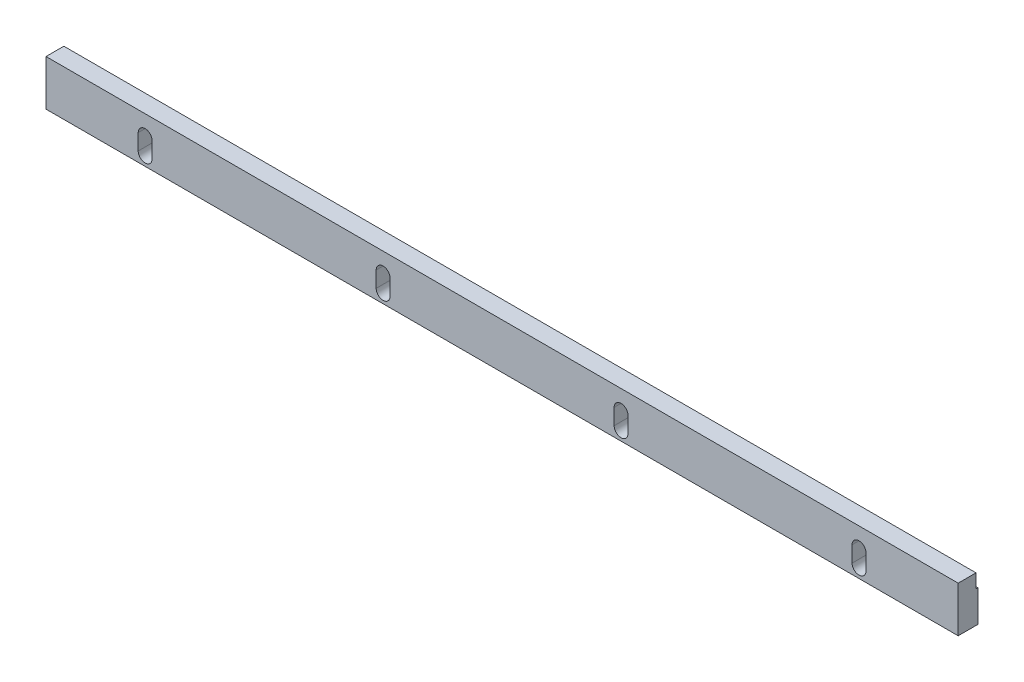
ISO-10303-21;
HEADER;
FILE_DESCRIPTION(('STEP AP214'),'2;1');
FILE_NAME('part.step','',(''),(''),'','','');
FILE_SCHEMA(('AUTOMOTIVE_DESIGN { 1 0 10303 214 1 1 1 1 }'));
ENDSEC;
DATA;
#1=APPLICATION_CONTEXT('core data for automotive mechanical design processes');
#2=APPLICATION_PROTOCOL_DEFINITION('international standard','automotive_design',2000,#1);
#3=PRODUCT_CONTEXT('',#1,'mechanical');
#4=PRODUCT('Part','Part','',(#3));
#5=PRODUCT_RELATED_PRODUCT_CATEGORY('part','',(#4));
#6=PRODUCT_DEFINITION_FORMATION('','',#4);
#7=PRODUCT_DEFINITION_CONTEXT('part definition',#1,'design');
#8=PRODUCT_DEFINITION('design','',#6,#7);
#9=PRODUCT_DEFINITION_SHAPE('','',#8);
#10=(LENGTH_UNIT() NAMED_UNIT(*) SI_UNIT(.MILLI.,.METRE.));
#11=(NAMED_UNIT(*) PLANE_ANGLE_UNIT() SI_UNIT($,.RADIAN.));
#12=(NAMED_UNIT(*) SI_UNIT($,.STERADIAN.) SOLID_ANGLE_UNIT());
#13=UNCERTAINTY_MEASURE_WITH_UNIT(LENGTH_MEASURE(1.E-05),#10,'distance_accuracy_value','');
#14=(GEOMETRIC_REPRESENTATION_CONTEXT(3) GLOBAL_UNCERTAINTY_ASSIGNED_CONTEXT((#13)) GLOBAL_UNIT_ASSIGNED_CONTEXT((#10,
#11,#12)) REPRESENTATION_CONTEXT('',''));
#15=CARTESIAN_POINT('',(0.,0.,0.));
#16=DIRECTION('',(0.,0.,1.));
#17=DIRECTION('',(1.,0.,0.));
#18=AXIS2_PLACEMENT_3D('',#15,#16,#17);
#19=CARTESIAN_POINT('',(0.,-13.3541654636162,5.));
#20=DIRECTION('',(-1.,0.,0.));
#21=DIRECTION('',(0.,-1.,0.));
#22=AXIS2_PLACEMENT_3D('',#19,#20,#21);
#23=PLANE('',#22);
#24=DIRECTION('',(0.,0.,1.));
#25=VECTOR('',#24,1.);
#26=CARTESIAN_POINT('',(0.,-5.35416546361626,0.));
#27=LINE('',#26,#25);
#28=CARTESIAN_POINT('',(0.,-5.35416546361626,0.));
#29=VERTEX_POINT('',#28);
#30=CARTESIAN_POINT('',(0.,-5.35416546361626,0.5));
#31=VERTEX_POINT('',#30);
#32=EDGE_CURVE('E212',#29,#31,#27,.T.);
#33=ORIENTED_EDGE('',*,*,#32,.T.);
#34=DIRECTION('',(0.,1.,0.));
#35=VECTOR('',#34,1.);
#36=CARTESIAN_POINT('',(0.,-1.85416546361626,0.5));
#37=LINE('',#36,#35);
#38=CARTESIAN_POINT('',(0.,-1.85416546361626,0.5));
#39=VERTEX_POINT('',#38);
#40=EDGE_CURVE('E223',#31,#39,#37,.T.);
#41=ORIENTED_EDGE('',*,*,#40,.T.);
#42=DIRECTION('',(0.,0.,-1.));
#43=VECTOR('',#42,1.);
#44=CARTESIAN_POINT('',(0.,-1.85416546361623,5.));
#45=LINE('',#44,#43);
#46=CARTESIAN_POINT('',(0.,-1.85416546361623,5.));
#47=VERTEX_POINT('',#46);
#48=EDGE_CURVE('E263',#47,#39,#45,.T.);
#49=ORIENTED_EDGE('',*,*,#48,.F.);
#50=DIRECTION('',(0.,1.,0.));
#51=VECTOR('',#50,1.);
#52=CARTESIAN_POINT('',(0.,-13.3541654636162,5.));
#53=LINE('',#52,#51);
#54=CARTESIAN_POINT('',(0.,-13.3541654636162,5.));
#55=VERTEX_POINT('',#54);
#56=EDGE_CURVE('E255',#55,#47,#53,.T.);
#57=ORIENTED_EDGE('',*,*,#56,.F.);
#58=DIRECTION('',(0.,0.,-1.));
#59=VECTOR('',#58,1.);
#60=CARTESIAN_POINT('',(0.,-13.3541654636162,5.));
#61=LINE('',#60,#59);
#62=CARTESIAN_POINT('',(0.,-13.3541654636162,0.));
#63=VERTEX_POINT('',#62);
#64=EDGE_CURVE('E242',#55,#63,#61,.T.);
#65=ORIENTED_EDGE('',*,*,#64,.T.);
#66=DIRECTION('',(0.,1.,0.));
#67=VECTOR('',#66,1.);
#68=CARTESIAN_POINT('',(0.,-13.3541654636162,0.));
#69=LINE('',#68,#67);
#70=EDGE_CURVE('E232',#63,#29,#69,.T.);
#71=ORIENTED_EDGE('',*,*,#70,.T.);
#72=EDGE_LOOP('',(#33,#41,#49,#57,#65,#71));
#73=FACE_BOUND('',#72,.T.);
#74=ADVANCED_FACE('F16',(#73),#23,.F.);
#75=CARTESIAN_POINT('',(0.,-1.85416546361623,5.));
#76=DIRECTION('',(0.,-1.,0.));
#77=DIRECTION('',(1.,0.,0.));
#78=AXIS2_PLACEMENT_3D('',#75,#76,#77);
#79=PLANE('',#78);
#80=ORIENTED_EDGE('',*,*,#48,.T.);
#81=DIRECTION('',(-1.,0.,0.));
#82=VECTOR('',#81,1.);
#83=CARTESIAN_POINT('',(0.,-1.85416546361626,0.5));
#84=LINE('',#83,#82);
#85=CARTESIAN_POINT('',(-230.,-1.85416546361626,0.5));
#86=VERTEX_POINT('',#85);
#87=EDGE_CURVE('E288',#39,#86,#84,.T.);
#88=ORIENTED_EDGE('',*,*,#87,.T.);
#89=DIRECTION('',(0.,0.,-1.));
#90=VECTOR('',#89,1.);
#91=CARTESIAN_POINT('',(-230.,-1.85416546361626,5.));
#92=LINE('',#91,#90);
#93=CARTESIAN_POINT('',(-230.,-1.85416546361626,5.));
#94=VERTEX_POINT('',#93);
#95=EDGE_CURVE('E260',#94,#86,#92,.T.);
#96=ORIENTED_EDGE('',*,*,#95,.F.);
#97=DIRECTION('',(-1.,0.,0.));
#98=VECTOR('',#97,1.);
#99=CARTESIAN_POINT('',(0.,-1.85416546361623,5.));
#100=LINE('',#99,#98);
#101=EDGE_CURVE('E439',#47,#94,#100,.T.);
#102=ORIENTED_EDGE('',*,*,#101,.F.);
#103=EDGE_LOOP('',(#80,#88,#96,#102));
#104=FACE_BOUND('',#103,.T.);
#105=ADVANCED_FACE('F451',(#104),#79,.F.);
#106=CARTESIAN_POINT('',(-230.,-13.3541654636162,5.));
#107=DIRECTION('',(1.,0.,0.));
#108=DIRECTION('',(0.,0.,-1.));
#109=AXIS2_PLACEMENT_3D('',#106,#107,#108);
#110=PLANE('',#109);
#111=ORIENTED_EDGE('',*,*,#95,.T.);
#112=DIRECTION('',(0.,1.,0.));
#113=VECTOR('',#112,1.);
#114=CARTESIAN_POINT('',(-230.,-1.85416546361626,0.5));
#115=LINE('',#114,#113);
#116=CARTESIAN_POINT('',(-230.,-5.35416546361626,0.5));
#117=VERTEX_POINT('',#116);
#118=EDGE_CURVE('E224',#117,#86,#115,.T.);
#119=ORIENTED_EDGE('',*,*,#118,.F.);
#120=DIRECTION('',(0.,0.,1.));
#121=VECTOR('',#120,1.);
#122=CARTESIAN_POINT('',(-230.,-5.35416546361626,0.));
#123=LINE('',#122,#121);
#124=CARTESIAN_POINT('',(-230.,-5.35416546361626,0.));
#125=VERTEX_POINT('',#124);
#126=EDGE_CURVE('E533',#125,#117,#123,.T.);
#127=ORIENTED_EDGE('',*,*,#126,.F.);
#128=DIRECTION('',(0.,-1.,0.));
#129=VECTOR('',#128,1.);
#130=CARTESIAN_POINT('',(-230.,-13.3541654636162,0.));
#131=LINE('',#130,#129);
#132=CARTESIAN_POINT('',(-230.,-13.3541654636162,0.));
#133=VERTEX_POINT('',#132);
#134=EDGE_CURVE('E243',#125,#133,#131,.T.);
#135=ORIENTED_EDGE('',*,*,#134,.T.);
#136=DIRECTION('',(0.,0.,-1.));
#137=VECTOR('',#136,1.);
#138=CARTESIAN_POINT('',(-230.,-13.3541654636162,5.));
#139=LINE('',#138,#137);
#140=CARTESIAN_POINT('',(-230.,-13.3541654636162,5.));
#141=VERTEX_POINT('',#140);
#142=EDGE_CURVE('E257',#141,#133,#139,.T.);
#143=ORIENTED_EDGE('',*,*,#142,.F.);
#144=DIRECTION('',(0.,-1.,0.));
#145=VECTOR('',#144,1.);
#146=CARTESIAN_POINT('',(-230.,-13.3541654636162,5.));
#147=LINE('',#146,#145);
#148=EDGE_CURVE('E440',#94,#141,#147,.T.);
#149=ORIENTED_EDGE('',*,*,#148,.F.);
#150=EDGE_LOOP('',(#111,#119,#127,#135,#143,#149));
#151=FACE_BOUND('',#150,.T.);
#152=ADVANCED_FACE('F455',(#151),#110,.F.);
#153=CARTESIAN_POINT('',(0.,-13.3541654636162,5.));
#154=DIRECTION('',(0.,1.,0.));
#155=DIRECTION('',(0.,0.,1.));
#156=AXIS2_PLACEMENT_3D('',#153,#154,#155);
#157=PLANE('',#156);
#158=DIRECTION('',(1.,0.,0.));
#159=VECTOR('',#158,1.);
#160=CARTESIAN_POINT('',(0.,-13.3541654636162,0.));
#161=LINE('',#160,#159);
#162=EDGE_CURVE('E246',#133,#63,#161,.T.);
#163=ORIENTED_EDGE('',*,*,#162,.T.);
#164=ORIENTED_EDGE('',*,*,#64,.F.);
#165=DIRECTION('',(1.,0.,0.));
#166=VECTOR('',#165,1.);
#167=CARTESIAN_POINT('',(0.,-13.3541654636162,5.));
#168=LINE('',#167,#166);
#169=EDGE_CURVE('E251',#141,#55,#168,.T.);
#170=ORIENTED_EDGE('',*,*,#169,.F.);
#171=ORIENTED_EDGE('',*,*,#142,.T.);
#172=EDGE_LOOP('',(#163,#164,#170,#171));
#173=FACE_BOUND('',#172,.T.);
#174=ADVANCED_FACE('F448',(#173),#157,.F.);
#175=CARTESIAN_POINT('',(0.,0.,5.));
#176=DIRECTION('',(0.,0.,1.));
#177=DIRECTION('',(1.,0.,0.));
#178=AXIS2_PLACEMENT_3D('',#175,#176,#177);
#179=PLANE('',#178);
#180=CARTESIAN_POINT('',(-205.,-6.85416546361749,5.));
#181=DIRECTION('',(0.,0.,1.));
#182=DIRECTION('',(1.,0.,0.));
#183=AXIS2_PLACEMENT_3D('',#180,#181,#182);
#184=CIRCLE('',#183,1.75000000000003);
#185=CARTESIAN_POINT('',(-203.25,-6.85416546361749,5.));
#186=VERTEX_POINT('',#185);
#187=CARTESIAN_POINT('',(-206.75,-6.85416546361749,5.));
#188=VERTEX_POINT('',#187);
#189=EDGE_CURVE('E38',#186,#188,#184,.T.);
#190=ORIENTED_EDGE('',*,*,#189,.F.);
#191=DIRECTION('',(0.,1.,0.));
#192=VECTOR('',#191,1.);
#193=CARTESIAN_POINT('',(-203.25,-6.85416546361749,5.));
#194=LINE('',#193,#192);
#195=CARTESIAN_POINT('',(-203.25,-10.8541654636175,5.));
#196=VERTEX_POINT('',#195);
#197=EDGE_CURVE('E334',#196,#186,#194,.T.);
#198=ORIENTED_EDGE('',*,*,#197,.F.);
#199=CARTESIAN_POINT('',(-205.,-10.8541654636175,5.));
#200=DIRECTION('',(0.,0.,1.));
#201=DIRECTION('',(1.,0.,0.));
#202=AXIS2_PLACEMENT_3D('',#199,#200,#201);
#203=CIRCLE('',#202,1.75000000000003);
#204=CARTESIAN_POINT('',(-206.75,-10.8541654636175,5.));
#205=VERTEX_POINT('',#204);
#206=EDGE_CURVE('E331',#205,#196,#203,.T.);
#207=ORIENTED_EDGE('',*,*,#206,.F.);
#208=DIRECTION('',(0.,-1.,0.));
#209=VECTOR('',#208,1.);
#210=CARTESIAN_POINT('',(-206.75,-6.85416546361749,5.));
#211=LINE('',#210,#209);
#212=EDGE_CURVE('E328',#188,#205,#211,.T.);
#213=ORIENTED_EDGE('',*,*,#212,.F.);
#214=EDGE_LOOP('',(#190,#198,#207,#213));
#215=FACE_BOUND('',#214,.T.);
#216=CARTESIAN_POINT('',(-145.,-6.85416546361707,5.));
#217=DIRECTION('',(0.,0.,1.));
#218=DIRECTION('',(1.,0.,0.));
#219=AXIS2_PLACEMENT_3D('',#216,#217,#218);
#220=CIRCLE('',#219,1.75000000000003);
#221=CARTESIAN_POINT('',(-143.25,-6.85416546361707,5.));
#222=VERTEX_POINT('',#221);
#223=CARTESIAN_POINT('',(-146.75,-6.85416546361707,5.));
#224=VERTEX_POINT('',#223);
#225=EDGE_CURVE('E339',#222,#224,#220,.T.);
#226=ORIENTED_EDGE('',*,*,#225,.F.);
#227=DIRECTION('',(0.,1.,0.));
#228=VECTOR('',#227,1.);
#229=CARTESIAN_POINT('',(-143.25,-6.85416546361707,5.));
#230=LINE('',#229,#228);
#231=CARTESIAN_POINT('',(-143.25,-10.8541654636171,5.));
#232=VERTEX_POINT('',#231);
#233=EDGE_CURVE('E366',#232,#222,#230,.T.);
#234=ORIENTED_EDGE('',*,*,#233,.F.);
#235=CARTESIAN_POINT('',(-145.,-10.8541654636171,5.));
#236=DIRECTION('',(0.,0.,1.));
#237=DIRECTION('',(1.,0.,0.));
#238=AXIS2_PLACEMENT_3D('',#235,#236,#237);
#239=CIRCLE('',#238,1.75000000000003);
#240=CARTESIAN_POINT('',(-146.75,-10.8541654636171,5.));
#241=VERTEX_POINT('',#240);
#242=EDGE_CURVE('E363',#241,#232,#239,.T.);
#243=ORIENTED_EDGE('',*,*,#242,.F.);
#244=DIRECTION('',(0.,-1.,0.));
#245=VECTOR('',#244,1.);
#246=CARTESIAN_POINT('',(-146.75,-6.85416546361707,5.));
#247=LINE('',#246,#245);
#248=EDGE_CURVE('E360',#224,#241,#247,.T.);
#249=ORIENTED_EDGE('',*,*,#248,.F.);
#250=EDGE_LOOP('',(#226,#234,#243,#249));
#251=FACE_BOUND('',#250,.T.);
#252=CARTESIAN_POINT('',(-85.,-6.85416546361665,5.));
#253=DIRECTION('',(0.,0.,1.));
#254=DIRECTION('',(1.,0.,0.));
#255=AXIS2_PLACEMENT_3D('',#252,#253,#254);
#256=CIRCLE('',#255,1.75);
#257=CARTESIAN_POINT('',(-83.25,-6.85416546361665,5.));
#258=VERTEX_POINT('',#257);
#259=CARTESIAN_POINT('',(-86.75,-6.85416546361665,5.));
#260=VERTEX_POINT('',#259);
#261=EDGE_CURVE('E371',#258,#260,#256,.T.);
#262=ORIENTED_EDGE('',*,*,#261,.F.);
#263=DIRECTION('',(0.,1.,0.));
#264=VECTOR('',#263,1.);
#265=CARTESIAN_POINT('',(-83.25,-6.85416546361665,5.));
#266=LINE('',#265,#264);
#267=CARTESIAN_POINT('',(-83.25,-10.8541654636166,5.));
#268=VERTEX_POINT('',#267);
#269=EDGE_CURVE('E399',#268,#258,#266,.T.);
#270=ORIENTED_EDGE('',*,*,#269,.F.);
#271=CARTESIAN_POINT('',(-85.,-10.8541654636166,5.));
#272=DIRECTION('',(0.,0.,1.));
#273=DIRECTION('',(1.,0.,0.));
#274=AXIS2_PLACEMENT_3D('',#271,#272,#273);
#275=CIRCLE('',#274,1.75);
#276=CARTESIAN_POINT('',(-86.75,-10.8541654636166,5.));
#277=VERTEX_POINT('',#276);
#278=EDGE_CURVE('E396',#277,#268,#275,.T.);
#279=ORIENTED_EDGE('',*,*,#278,.F.);
#280=DIRECTION('',(0.,-1.,0.));
#281=VECTOR('',#280,1.);
#282=CARTESIAN_POINT('',(-86.75,-6.85416546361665,5.));
#283=LINE('',#282,#281);
#284=EDGE_CURVE('E393',#260,#277,#283,.T.);
#285=ORIENTED_EDGE('',*,*,#284,.F.);
#286=EDGE_LOOP('',(#262,#270,#279,#285));
#287=FACE_BOUND('',#286,.T.);
#288=CARTESIAN_POINT('',(-25.,-6.85416546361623,5.));
#289=DIRECTION('',(0.,0.,1.));
#290=DIRECTION('',(1.,0.,0.));
#291=AXIS2_PLACEMENT_3D('',#288,#289,#290);
#292=CIRCLE('',#291,1.75);
#293=CARTESIAN_POINT('',(-23.25,-6.85416546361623,5.));
#294=VERTEX_POINT('',#293);
#295=CARTESIAN_POINT('',(-26.75,-6.85416546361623,5.));
#296=VERTEX_POINT('',#295);
#297=EDGE_CURVE('E404',#294,#296,#292,.T.);
#298=ORIENTED_EDGE('',*,*,#297,.F.);
#299=DIRECTION('',(0.,1.,0.));
#300=VECTOR('',#299,1.);
#301=CARTESIAN_POINT('',(-23.25,-6.85416546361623,5.));
#302=LINE('',#301,#300);
#303=CARTESIAN_POINT('',(-23.25,-10.8541654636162,5.));
#304=VERTEX_POINT('',#303);
#305=EDGE_CURVE('E429',#304,#294,#302,.T.);
#306=ORIENTED_EDGE('',*,*,#305,.F.);
#307=CARTESIAN_POINT('',(-25.,-10.8541654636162,5.));
#308=DIRECTION('',(0.,0.,1.));
#309=DIRECTION('',(1.,0.,0.));
#310=AXIS2_PLACEMENT_3D('',#307,#308,#309);
#311=CIRCLE('',#310,1.75);
#312=CARTESIAN_POINT('',(-26.75,-10.8541654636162,5.));
#313=VERTEX_POINT('',#312);
#314=EDGE_CURVE('E426',#313,#304,#311,.T.);
#315=ORIENTED_EDGE('',*,*,#314,.F.);
#316=DIRECTION('',(0.,-1.,0.));
#317=VECTOR('',#316,1.);
#318=CARTESIAN_POINT('',(-26.75,-6.85416546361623,5.));
#319=LINE('',#318,#317);
#320=EDGE_CURVE('E423',#296,#313,#319,.T.);
#321=ORIENTED_EDGE('',*,*,#320,.F.);
#322=EDGE_LOOP('',(#298,#306,#315,#321));
#323=FACE_BOUND('',#322,.T.);
#324=ORIENTED_EDGE('',*,*,#56,.T.);
#325=ORIENTED_EDGE('',*,*,#101,.T.);
#326=ORIENTED_EDGE('',*,*,#148,.T.);
#327=ORIENTED_EDGE('',*,*,#169,.T.);
#328=EDGE_LOOP('',(#324,#325,#326,#327));
#329=FACE_BOUND('',#328,.T.);
#330=ADVANCED_FACE('F445',(#215,#251,#287,#323,#329),#179,.T.);
#331=CARTESIAN_POINT('',(0.,0.,0.));
#332=DIRECTION('',(0.,0.,1.));
#333=DIRECTION('',(1.,0.,0.));
#334=AXIS2_PLACEMENT_3D('',#331,#332,#333);
#335=PLANE('',#334);
#336=ORIENTED_EDGE('',*,*,#134,.F.);
#337=DIRECTION('',(-1.,0.,0.));
#338=VECTOR('',#337,1.);
#339=CARTESIAN_POINT('',(0.,-5.35416546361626,0.));
#340=LINE('',#339,#338);
#341=CARTESIAN_POINT('',(-205.901387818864,-5.35416546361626,0.));
#342=VERTEX_POINT('',#341);
#343=EDGE_CURVE('E238',#342,#125,#340,.T.);
#344=ORIENTED_EDGE('',*,*,#343,.F.);
#345=CARTESIAN_POINT('',(-205.,-6.85416546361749,0.));
#346=DIRECTION('',(0.,0.,1.));
#347=DIRECTION('',(1.,0.,0.));
#348=AXIS2_PLACEMENT_3D('',#345,#346,#347);
#349=CIRCLE('',#348,1.75000000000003);
#350=CARTESIAN_POINT('',(-206.75,-6.85416546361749,0.));
#351=VERTEX_POINT('',#350);
#352=EDGE_CURVE('E317',#342,#351,#349,.T.);
#353=ORIENTED_EDGE('',*,*,#352,.T.);
#354=DIRECTION('',(0.,-1.,0.));
#355=VECTOR('',#354,1.);
#356=CARTESIAN_POINT('',(-206.75,-6.85416546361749,0.));
#357=LINE('',#356,#355);
#358=CARTESIAN_POINT('',(-206.75,-10.8541654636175,0.));
#359=VERTEX_POINT('',#358);
#360=EDGE_CURVE('E316',#351,#359,#357,.T.);
#361=ORIENTED_EDGE('',*,*,#360,.T.);
#362=CARTESIAN_POINT('',(-205.,-10.8541654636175,0.));
#363=DIRECTION('',(0.,0.,1.));
#364=DIRECTION('',(1.,0.,0.));
#365=AXIS2_PLACEMENT_3D('',#362,#363,#364);
#366=CIRCLE('',#365,1.75000000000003);
#367=CARTESIAN_POINT('',(-203.25,-10.8541654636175,0.));
#368=VERTEX_POINT('',#367);
#369=EDGE_CURVE('E320',#359,#368,#366,.T.);
#370=ORIENTED_EDGE('',*,*,#369,.T.);
#371=DIRECTION('',(0.,1.,0.));
#372=VECTOR('',#371,1.);
#373=CARTESIAN_POINT('',(-203.25,-6.85416546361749,0.));
#374=LINE('',#373,#372);
#375=CARTESIAN_POINT('',(-203.25,-6.85416546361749,0.));
#376=VERTEX_POINT('',#375);
#377=EDGE_CURVE('E323',#368,#376,#374,.T.);
#378=ORIENTED_EDGE('',*,*,#377,.T.);
#379=CARTESIAN_POINT('',(-204.098612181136,-5.35416546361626,0.));
#380=VERTEX_POINT('',#379);
#381=EDGE_CURVE('E314',#376,#380,#349,.T.);
#382=ORIENTED_EDGE('',*,*,#381,.T.);
#383=CARTESIAN_POINT('',(-145.901387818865,-5.35416546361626,0.));
#384=VERTEX_POINT('',#383);
#385=EDGE_CURVE('E458',#384,#380,#340,.T.);
#386=ORIENTED_EDGE('',*,*,#385,.F.);
#387=CARTESIAN_POINT('',(-145.,-6.85416546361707,0.));
#388=DIRECTION('',(0.,0.,1.));
#389=DIRECTION('',(1.,0.,0.));
#390=AXIS2_PLACEMENT_3D('',#387,#388,#389);
#391=CIRCLE('',#390,1.75000000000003);
#392=CARTESIAN_POINT('',(-146.75,-6.85416546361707,0.));
#393=VERTEX_POINT('',#392);
#394=EDGE_CURVE('E349',#384,#393,#391,.T.);
#395=ORIENTED_EDGE('',*,*,#394,.T.);
#396=DIRECTION('',(0.,-1.,0.));
#397=VECTOR('',#396,1.);
#398=CARTESIAN_POINT('',(-146.75,-6.85416546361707,0.));
#399=LINE('',#398,#397);
#400=CARTESIAN_POINT('',(-146.75,-10.8541654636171,0.));
#401=VERTEX_POINT('',#400);
#402=EDGE_CURVE('E348',#393,#401,#399,.T.);
#403=ORIENTED_EDGE('',*,*,#402,.T.);
#404=CARTESIAN_POINT('',(-145.,-10.8541654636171,0.));
#405=DIRECTION('',(0.,0.,1.));
#406=DIRECTION('',(1.,0.,0.));
#407=AXIS2_PLACEMENT_3D('',#404,#405,#406);
#408=CIRCLE('',#407,1.75000000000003);
#409=CARTESIAN_POINT('',(-143.25,-10.8541654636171,0.));
#410=VERTEX_POINT('',#409);
#411=EDGE_CURVE('E352',#401,#410,#408,.T.);
#412=ORIENTED_EDGE('',*,*,#411,.T.);
#413=DIRECTION('',(0.,1.,0.));
#414=VECTOR('',#413,1.);
#415=CARTESIAN_POINT('',(-143.25,-6.85416546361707,0.));
#416=LINE('',#415,#414);
#417=CARTESIAN_POINT('',(-143.25,-6.85416546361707,0.));
#418=VERTEX_POINT('',#417);
#419=EDGE_CURVE('E355',#410,#418,#416,.T.);
#420=ORIENTED_EDGE('',*,*,#419,.T.);
#421=CARTESIAN_POINT('',(-144.098612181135,-5.35416546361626,0.));
#422=VERTEX_POINT('',#421);
#423=EDGE_CURVE('E345',#418,#422,#391,.T.);
#424=ORIENTED_EDGE('',*,*,#423,.T.);
#425=CARTESIAN_POINT('',(-85.9013878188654,-5.35416546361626,0.));
#426=VERTEX_POINT('',#425);
#427=EDGE_CURVE('E474',#426,#422,#340,.T.);
#428=ORIENTED_EDGE('',*,*,#427,.F.);
#429=CARTESIAN_POINT('',(-85.,-6.85416546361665,0.));
#430=DIRECTION('',(0.,0.,1.));
#431=DIRECTION('',(1.,0.,0.));
#432=AXIS2_PLACEMENT_3D('',#429,#430,#431);
#433=CIRCLE('',#432,1.75);
#434=CARTESIAN_POINT('',(-86.75,-6.85416546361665,0.));
#435=VERTEX_POINT('',#434);
#436=EDGE_CURVE('E382',#426,#435,#433,.T.);
#437=ORIENTED_EDGE('',*,*,#436,.T.);
#438=DIRECTION('',(0.,-1.,0.));
#439=VECTOR('',#438,1.);
#440=CARTESIAN_POINT('',(-86.75,-6.85416546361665,0.));
#441=LINE('',#440,#439);
#442=CARTESIAN_POINT('',(-86.75,-10.8541654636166,0.));
#443=VERTEX_POINT('',#442);
#444=EDGE_CURVE('E381',#435,#443,#441,.T.);
#445=ORIENTED_EDGE('',*,*,#444,.T.);
#446=CARTESIAN_POINT('',(-85.,-10.8541654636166,0.));
#447=DIRECTION('',(0.,0.,1.));
#448=DIRECTION('',(1.,0.,0.));
#449=AXIS2_PLACEMENT_3D('',#446,#447,#448);
#450=CIRCLE('',#449,1.75);
#451=CARTESIAN_POINT('',(-83.25,-10.8541654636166,0.));
#452=VERTEX_POINT('',#451);
#453=EDGE_CURVE('E385',#443,#452,#450,.T.);
#454=ORIENTED_EDGE('',*,*,#453,.T.);
#455=DIRECTION('',(0.,1.,0.));
#456=VECTOR('',#455,1.);
#457=CARTESIAN_POINT('',(-83.25,-6.85416546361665,0.));
#458=LINE('',#457,#456);
#459=CARTESIAN_POINT('',(-83.25,-6.85416546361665,0.));
#460=VERTEX_POINT('',#459);
#461=EDGE_CURVE('E388',#452,#460,#458,.T.);
#462=ORIENTED_EDGE('',*,*,#461,.T.);
#463=CARTESIAN_POINT('',(-84.0986121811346,-5.35416546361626,0.));
#464=VERTEX_POINT('',#463);
#465=EDGE_CURVE('E378',#460,#464,#433,.T.);
#466=ORIENTED_EDGE('',*,*,#465,.T.);
#467=CARTESIAN_POINT('',(-25.9013878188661,-5.35416546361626,0.));
#468=VERTEX_POINT('',#467);
#469=EDGE_CURVE('E236',#468,#464,#340,.T.);
#470=ORIENTED_EDGE('',*,*,#469,.F.);
#471=CARTESIAN_POINT('',(-25.,-6.85416546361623,0.));
#472=DIRECTION('',(0.,0.,1.));
#473=DIRECTION('',(1.,0.,0.));
#474=AXIS2_PLACEMENT_3D('',#471,#472,#473);
#475=CIRCLE('',#474,1.75);
#476=CARTESIAN_POINT('',(-26.75,-6.85416546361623,0.));
#477=VERTEX_POINT('',#476);
#478=EDGE_CURVE('E413',#468,#477,#475,.T.);
#479=ORIENTED_EDGE('',*,*,#478,.T.);
#480=DIRECTION('',(0.,-1.,0.));
#481=VECTOR('',#480,1.);
#482=CARTESIAN_POINT('',(-26.75,-6.85416546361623,0.));
#483=LINE('',#482,#481);
#484=CARTESIAN_POINT('',(-26.75,-10.8541654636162,0.));
#485=VERTEX_POINT('',#484);
#486=EDGE_CURVE('E412',#477,#485,#483,.T.);
#487=ORIENTED_EDGE('',*,*,#486,.T.);
#488=CARTESIAN_POINT('',(-25.,-10.8541654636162,0.));
#489=DIRECTION('',(0.,0.,1.));
#490=DIRECTION('',(1.,0.,0.));
#491=AXIS2_PLACEMENT_3D('',#488,#489,#490);
#492=CIRCLE('',#491,1.75);
#493=CARTESIAN_POINT('',(-23.25,-10.8541654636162,0.));
#494=VERTEX_POINT('',#493);
#495=EDGE_CURVE('E416',#485,#494,#492,.T.);
#496=ORIENTED_EDGE('',*,*,#495,.T.);
#497=DIRECTION('',(0.,1.,0.));
#498=VECTOR('',#497,1.);
#499=CARTESIAN_POINT('',(-23.25,-6.85416546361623,0.));
#500=LINE('',#499,#498);
#501=CARTESIAN_POINT('',(-23.25,-6.85416546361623,0.));
#502=VERTEX_POINT('',#501);
#503=EDGE_CURVE('E419',#494,#502,#500,.T.);
#504=ORIENTED_EDGE('',*,*,#503,.T.);
#505=CARTESIAN_POINT('',(-24.098612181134,-5.35416546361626,0.));
#506=VERTEX_POINT('',#505);
#507=EDGE_CURVE('E235',#502,#506,#475,.T.);
#508=ORIENTED_EDGE('',*,*,#507,.T.);
#509=EDGE_CURVE('E215',#29,#506,#340,.T.);
#510=ORIENTED_EDGE('',*,*,#509,.F.);
#511=ORIENTED_EDGE('',*,*,#70,.F.);
#512=ORIENTED_EDGE('',*,*,#162,.F.);
#513=EDGE_LOOP('',(#336,#344,#353,#361,#370,#378,#382,#386,#395,#403,#412,#420,#424,#428,#437,
#445,#454,#462,#466,#470,#479,#487,#496,#504,#508,#510,#511,#512));
#514=FACE_BOUND('',#513,.T.);
#515=ADVANCED_FACE('F230',(#514),#335,.F.);
#516=CARTESIAN_POINT('',(-25.,-6.85416546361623,0.));
#517=DIRECTION('',(0.,0.,1.));
#518=DIRECTION('',(1.,0.,0.));
#519=AXIS2_PLACEMENT_3D('',#516,#517,#518);
#520=CYLINDRICAL_SURFACE('',#519,1.75);
#521=CARTESIAN_POINT('',(-25.,-6.85416546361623,0.5));
#522=DIRECTION('',(0.,0.,1.));
#523=DIRECTION('',(0.,-1.,0.));
#524=AXIS2_PLACEMENT_3D('',#521,#522,#523);
#525=CIRCLE('',#524,1.75);
#526=CARTESIAN_POINT('',(-25.9013878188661,-5.35416546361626,0.5));
#527=VERTEX_POINT('',#526);
#528=CARTESIAN_POINT('',(-24.098612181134,-5.35416546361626,0.5));
#529=VERTEX_POINT('',#528);
#530=EDGE_CURVE('E311',#527,#529,#525,.F.);
#531=ORIENTED_EDGE('',*,*,#530,.T.);
#532=DIRECTION('',(0.,0.,1.));
#533=VECTOR('',#532,1.);
#534=CARTESIAN_POINT('',(-24.098612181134,-5.35416546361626,0.));
#535=LINE('',#534,#533);
#536=EDGE_CURVE('E305',#529,#506,#535,.F.);
#537=ORIENTED_EDGE('',*,*,#536,.T.);
#538=ORIENTED_EDGE('',*,*,#507,.F.);
#539=DIRECTION('',(0.,0.,1.));
#540=VECTOR('',#539,1.);
#541=CARTESIAN_POINT('',(-23.25,-6.85416546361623,0.));
#542=LINE('',#541,#540);
#543=EDGE_CURVE('E244',#502,#294,#542,.T.);
#544=ORIENTED_EDGE('',*,*,#543,.T.);
#545=ORIENTED_EDGE('',*,*,#297,.T.);
#546=DIRECTION('',(0.,0.,1.));
#547=VECTOR('',#546,1.);
#548=CARTESIAN_POINT('',(-26.75,-6.85416546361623,0.));
#549=LINE('',#548,#547);
#550=EDGE_CURVE('E421',#477,#296,#549,.T.);
#551=ORIENTED_EDGE('',*,*,#550,.F.);
#552=ORIENTED_EDGE('',*,*,#478,.F.);
#553=DIRECTION('',(0.,0.,1.));
#554=VECTOR('',#553,1.);
#555=CARTESIAN_POINT('',(-25.9013878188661,-5.35416546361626,0.));
#556=LINE('',#555,#554);
#557=EDGE_CURVE('E302',#468,#527,#556,.T.);
#558=ORIENTED_EDGE('',*,*,#557,.T.);
#559=EDGE_LOOP('',(#531,#537,#538,#544,#545,#551,#552,#558));
#560=FACE_BOUND('',#559,.T.);
#561=ADVANCED_FACE('F516',(#560),#520,.F.);
#562=CARTESIAN_POINT('',(-23.25,-6.85416546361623,0.));
#563=DIRECTION('',(1.,0.,0.));
#564=DIRECTION('',(0.,0.,-1.));
#565=AXIS2_PLACEMENT_3D('',#562,#563,#564);
#566=PLANE('',#565);
#567=ORIENTED_EDGE('',*,*,#305,.T.);
#568=ORIENTED_EDGE('',*,*,#543,.F.);
#569=ORIENTED_EDGE('',*,*,#503,.F.);
#570=DIRECTION('',(0.,0.,1.));
#571=VECTOR('',#570,1.);
#572=CARTESIAN_POINT('',(-23.25,-10.8541654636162,0.));
#573=LINE('',#572,#571);
#574=EDGE_CURVE('E248',#494,#304,#573,.T.);
#575=ORIENTED_EDGE('',*,*,#574,.T.);
#576=EDGE_LOOP('',(#567,#568,#569,#575));
#577=FACE_BOUND('',#576,.T.);
#578=ADVANCED_FACE('F529',(#577),#566,.F.);
#579=CARTESIAN_POINT('',(-25.,-10.8541654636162,0.));
#580=DIRECTION('',(0.,0.,1.));
#581=DIRECTION('',(1.,0.,0.));
#582=AXIS2_PLACEMENT_3D('',#579,#580,#581);
#583=CYLINDRICAL_SURFACE('',#582,1.75);
#584=ORIENTED_EDGE('',*,*,#314,.T.);
#585=ORIENTED_EDGE('',*,*,#574,.F.);
#586=ORIENTED_EDGE('',*,*,#495,.F.);
#587=DIRECTION('',(0.,0.,1.));
#588=VECTOR('',#587,1.);
#589=CARTESIAN_POINT('',(-26.75,-10.8541654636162,0.));
#590=LINE('',#589,#588);
#591=EDGE_CURVE('E433',#485,#313,#590,.T.);
#592=ORIENTED_EDGE('',*,*,#591,.T.);
#593=EDGE_LOOP('',(#584,#585,#586,#592));
#594=FACE_BOUND('',#593,.T.);
#595=ADVANCED_FACE('F525',(#594),#583,.F.);
#596=CARTESIAN_POINT('',(-26.75,-6.85416546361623,0.));
#597=DIRECTION('',(-1.,0.,0.));
#598=DIRECTION('',(0.,0.,1.));
#599=AXIS2_PLACEMENT_3D('',#596,#597,#598);
#600=PLANE('',#599);
#601=ORIENTED_EDGE('',*,*,#320,.T.);
#602=ORIENTED_EDGE('',*,*,#591,.F.);
#603=ORIENTED_EDGE('',*,*,#486,.F.);
#604=ORIENTED_EDGE('',*,*,#550,.T.);
#605=EDGE_LOOP('',(#601,#602,#603,#604));
#606=FACE_BOUND('',#605,.T.);
#607=ADVANCED_FACE('F522',(#606),#600,.F.);
#608=CARTESIAN_POINT('',(-85.,-6.85416546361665,0.));
#609=DIRECTION('',(0.,0.,1.));
#610=DIRECTION('',(1.,0.,0.));
#611=AXIS2_PLACEMENT_3D('',#608,#609,#610);
#612=CYLINDRICAL_SURFACE('',#611,1.75);
#613=CARTESIAN_POINT('',(-85.,-6.85416546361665,0.5));
#614=DIRECTION('',(0.,0.,1.));
#615=DIRECTION('',(0.,-1.,0.));
#616=AXIS2_PLACEMENT_3D('',#613,#614,#615);
#617=CIRCLE('',#616,1.75);
#618=CARTESIAN_POINT('',(-85.9013878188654,-5.35416546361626,0.5));
#619=VERTEX_POINT('',#618);
#620=CARTESIAN_POINT('',(-84.0986121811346,-5.35416546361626,0.5));
#621=VERTEX_POINT('',#620);
#622=EDGE_CURVE('E308',#619,#621,#617,.F.);
#623=ORIENTED_EDGE('',*,*,#622,.T.);
#624=DIRECTION('',(0.,0.,1.));
#625=VECTOR('',#624,1.);
#626=CARTESIAN_POINT('',(-84.0986121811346,-5.35416546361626,0.));
#627=LINE('',#626,#625);
#628=EDGE_CURVE('E299',#621,#464,#627,.F.);
#629=ORIENTED_EDGE('',*,*,#628,.T.);
#630=ORIENTED_EDGE('',*,*,#465,.F.);
#631=DIRECTION('',(0.,0.,1.));
#632=VECTOR('',#631,1.);
#633=CARTESIAN_POINT('',(-83.25,-6.85416546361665,0.));
#634=LINE('',#633,#632);
#635=EDGE_CURVE('E402',#460,#258,#634,.T.);
#636=ORIENTED_EDGE('',*,*,#635,.T.);
#637=ORIENTED_EDGE('',*,*,#261,.T.);
#638=DIRECTION('',(0.,0.,1.));
#639=VECTOR('',#638,1.);
#640=CARTESIAN_POINT('',(-86.75,-6.85416546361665,0.));
#641=LINE('',#640,#639);
#642=EDGE_CURVE('E391',#435,#260,#641,.T.);
#643=ORIENTED_EDGE('',*,*,#642,.F.);
#644=ORIENTED_EDGE('',*,*,#436,.F.);
#645=DIRECTION('',(0.,0.,1.));
#646=VECTOR('',#645,1.);
#647=CARTESIAN_POINT('',(-85.9013878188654,-5.35416546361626,0.));
#648=LINE('',#647,#646);
#649=EDGE_CURVE('E296',#426,#619,#648,.T.);
#650=ORIENTED_EDGE('',*,*,#649,.T.);
#651=EDGE_LOOP('',(#623,#629,#630,#636,#637,#643,#644,#650));
#652=FACE_BOUND('',#651,.T.);
#653=ADVANCED_FACE('F496',(#652),#612,.F.);
#654=CARTESIAN_POINT('',(-83.25,-6.85416546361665,0.));
#655=DIRECTION('',(1.,0.,0.));
#656=DIRECTION('',(0.,0.,-1.));
#657=AXIS2_PLACEMENT_3D('',#654,#655,#656);
#658=PLANE('',#657);
#659=ORIENTED_EDGE('',*,*,#269,.T.);
#660=ORIENTED_EDGE('',*,*,#635,.F.);
#661=ORIENTED_EDGE('',*,*,#461,.F.);
#662=DIRECTION('',(0.,0.,1.));
#663=VECTOR('',#662,1.);
#664=CARTESIAN_POINT('',(-83.25,-10.8541654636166,0.));
#665=LINE('',#664,#663);
#666=EDGE_CURVE('E405',#452,#268,#665,.T.);
#667=ORIENTED_EDGE('',*,*,#666,.T.);
#668=EDGE_LOOP('',(#659,#660,#661,#667));
#669=FACE_BOUND('',#668,.T.);
#670=ADVANCED_FACE('F509',(#669),#658,.F.);
#671=CARTESIAN_POINT('',(-85.,-10.8541654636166,0.));
#672=DIRECTION('',(0.,0.,1.));
#673=DIRECTION('',(1.,0.,0.));
#674=AXIS2_PLACEMENT_3D('',#671,#672,#673);
#675=CYLINDRICAL_SURFACE('',#674,1.75);
#676=ORIENTED_EDGE('',*,*,#278,.T.);
#677=ORIENTED_EDGE('',*,*,#666,.F.);
#678=ORIENTED_EDGE('',*,*,#453,.F.);
#679=DIRECTION('',(0.,0.,1.));
#680=VECTOR('',#679,1.);
#681=CARTESIAN_POINT('',(-86.75,-10.8541654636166,0.));
#682=LINE('',#681,#680);
#683=EDGE_CURVE('E407',#443,#277,#682,.T.);
#684=ORIENTED_EDGE('',*,*,#683,.T.);
#685=EDGE_LOOP('',(#676,#677,#678,#684));
#686=FACE_BOUND('',#685,.T.);
#687=ADVANCED_FACE('F505',(#686),#675,.F.);
#688=CARTESIAN_POINT('',(-86.75,-6.85416546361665,0.));
#689=DIRECTION('',(-1.,0.,0.));
#690=DIRECTION('',(0.,0.,1.));
#691=AXIS2_PLACEMENT_3D('',#688,#689,#690);
#692=PLANE('',#691);
#693=ORIENTED_EDGE('',*,*,#284,.T.);
#694=ORIENTED_EDGE('',*,*,#683,.F.);
#695=ORIENTED_EDGE('',*,*,#444,.F.);
#696=ORIENTED_EDGE('',*,*,#642,.T.);
#697=EDGE_LOOP('',(#693,#694,#695,#696));
#698=FACE_BOUND('',#697,.T.);
#699=ADVANCED_FACE('F502',(#698),#692,.F.);
#700=CARTESIAN_POINT('',(-145.,-6.85416546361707,0.));
#701=DIRECTION('',(0.,0.,1.));
#702=DIRECTION('',(1.,0.,0.));
#703=AXIS2_PLACEMENT_3D('',#700,#701,#702);
#704=CYLINDRICAL_SURFACE('',#703,1.75000000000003);
#705=CARTESIAN_POINT('',(-145.,-6.85416546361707,0.5));
#706=DIRECTION('',(0.,0.,1.));
#707=DIRECTION('',(0.,-1.,0.));
#708=AXIS2_PLACEMENT_3D('',#705,#706,#707);
#709=CIRCLE('',#708,1.75000000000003);
#710=CARTESIAN_POINT('',(-145.901387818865,-5.35416546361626,0.5));
#711=VERTEX_POINT('',#710);
#712=CARTESIAN_POINT('',(-144.098612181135,-5.35416546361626,0.5));
#713=VERTEX_POINT('',#712);
#714=EDGE_CURVE('E281',#711,#713,#709,.F.);
#715=ORIENTED_EDGE('',*,*,#714,.T.);
#716=DIRECTION('',(0.,0.,1.));
#717=VECTOR('',#716,1.);
#718=CARTESIAN_POINT('',(-144.098612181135,-5.35416546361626,0.));
#719=LINE('',#718,#717);
#720=EDGE_CURVE('E293',#713,#422,#719,.F.);
#721=ORIENTED_EDGE('',*,*,#720,.T.);
#722=ORIENTED_EDGE('',*,*,#423,.F.);
#723=DIRECTION('',(0.,0.,1.));
#724=VECTOR('',#723,1.);
#725=CARTESIAN_POINT('',(-143.25,-6.85416546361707,0.));
#726=LINE('',#725,#724);
#727=EDGE_CURVE('E369',#418,#222,#726,.T.);
#728=ORIENTED_EDGE('',*,*,#727,.T.);
#729=ORIENTED_EDGE('',*,*,#225,.T.);
#730=DIRECTION('',(0.,0.,1.));
#731=VECTOR('',#730,1.);
#732=CARTESIAN_POINT('',(-146.75,-6.85416546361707,0.));
#733=LINE('',#732,#731);
#734=EDGE_CURVE('E358',#393,#224,#733,.T.);
#735=ORIENTED_EDGE('',*,*,#734,.F.);
#736=ORIENTED_EDGE('',*,*,#394,.F.);
#737=DIRECTION('',(0.,0.,1.));
#738=VECTOR('',#737,1.);
#739=CARTESIAN_POINT('',(-145.901387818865,-5.35416546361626,0.));
#740=LINE('',#739,#738);
#741=EDGE_CURVE('E291',#384,#711,#740,.T.);
#742=ORIENTED_EDGE('',*,*,#741,.T.);
#743=EDGE_LOOP('',(#715,#721,#722,#728,#729,#735,#736,#742));
#744=FACE_BOUND('',#743,.T.);
#745=ADVANCED_FACE('F476',(#744),#704,.F.);
#746=CARTESIAN_POINT('',(-143.25,-6.85416546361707,0.));
#747=DIRECTION('',(1.,0.,0.));
#748=DIRECTION('',(0.,0.,-1.));
#749=AXIS2_PLACEMENT_3D('',#746,#747,#748);
#750=PLANE('',#749);
#751=ORIENTED_EDGE('',*,*,#233,.T.);
#752=ORIENTED_EDGE('',*,*,#727,.F.);
#753=ORIENTED_EDGE('',*,*,#419,.F.);
#754=DIRECTION('',(0.,0.,1.));
#755=VECTOR('',#754,1.);
#756=CARTESIAN_POINT('',(-143.25,-10.8541654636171,0.));
#757=LINE('',#756,#755);
#758=EDGE_CURVE('E372',#410,#232,#757,.T.);
#759=ORIENTED_EDGE('',*,*,#758,.T.);
#760=EDGE_LOOP('',(#751,#752,#753,#759));
#761=FACE_BOUND('',#760,.T.);
#762=ADVANCED_FACE('F489',(#761),#750,.F.);
#763=CARTESIAN_POINT('',(-145.,-10.8541654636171,0.));
#764=DIRECTION('',(0.,0.,1.));
#765=DIRECTION('',(1.,0.,0.));
#766=AXIS2_PLACEMENT_3D('',#763,#764,#765);
#767=CYLINDRICAL_SURFACE('',#766,1.75000000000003);
#768=ORIENTED_EDGE('',*,*,#242,.T.);
#769=ORIENTED_EDGE('',*,*,#758,.F.);
#770=ORIENTED_EDGE('',*,*,#411,.F.);
#771=DIRECTION('',(0.,0.,1.));
#772=VECTOR('',#771,1.);
#773=CARTESIAN_POINT('',(-146.75,-10.8541654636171,0.));
#774=LINE('',#773,#772);
#775=EDGE_CURVE('E374',#401,#241,#774,.T.);
#776=ORIENTED_EDGE('',*,*,#775,.T.);
#777=EDGE_LOOP('',(#768,#769,#770,#776));
#778=FACE_BOUND('',#777,.T.);
#779=ADVANCED_FACE('F485',(#778),#767,.F.);
#780=CARTESIAN_POINT('',(-146.75,-6.85416546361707,0.));
#781=DIRECTION('',(-1.,0.,0.));
#782=DIRECTION('',(0.,0.,1.));
#783=AXIS2_PLACEMENT_3D('',#780,#781,#782);
#784=PLANE('',#783);
#785=ORIENTED_EDGE('',*,*,#248,.T.);
#786=ORIENTED_EDGE('',*,*,#775,.F.);
#787=ORIENTED_EDGE('',*,*,#402,.F.);
#788=ORIENTED_EDGE('',*,*,#734,.T.);
#789=EDGE_LOOP('',(#785,#786,#787,#788));
#790=FACE_BOUND('',#789,.T.);
#791=ADVANCED_FACE('F482',(#790),#784,.F.);
#792=CARTESIAN_POINT('',(-205.,-6.85416546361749,0.));
#793=DIRECTION('',(0.,0.,1.));
#794=DIRECTION('',(1.,0.,0.));
#795=AXIS2_PLACEMENT_3D('',#792,#793,#794);
#796=CYLINDRICAL_SURFACE('',#795,1.75000000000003);
#797=CARTESIAN_POINT('',(-205.,-6.85416546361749,0.5));
#798=DIRECTION('',(0.,0.,1.));
#799=DIRECTION('',(0.,-1.,0.));
#800=AXIS2_PLACEMENT_3D('',#797,#798,#799);
#801=CIRCLE('',#800,1.75000000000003);
#802=CARTESIAN_POINT('',(-205.901387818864,-5.35416546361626,0.5));
#803=VERTEX_POINT('',#802);
#804=CARTESIAN_POINT('',(-204.098612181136,-5.35416546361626,0.5));
#805=VERTEX_POINT('',#804);
#806=EDGE_CURVE('E23',#803,#805,#801,.F.);
#807=ORIENTED_EDGE('',*,*,#806,.T.);
#808=DIRECTION('',(0.,0.,1.));
#809=VECTOR('',#808,1.);
#810=CARTESIAN_POINT('',(-204.098612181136,-5.35416546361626,0.));
#811=LINE('',#810,#809);
#812=EDGE_CURVE('E11',#805,#380,#811,.F.);
#813=ORIENTED_EDGE('',*,*,#812,.T.);
#814=ORIENTED_EDGE('',*,*,#381,.F.);
#815=DIRECTION('',(0.,0.,1.));
#816=VECTOR('',#815,1.);
#817=CARTESIAN_POINT('',(-203.25,-6.85416546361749,0.));
#818=LINE('',#817,#816);
#819=EDGE_CURVE('E337',#376,#186,#818,.T.);
#820=ORIENTED_EDGE('',*,*,#819,.T.);
#821=ORIENTED_EDGE('',*,*,#189,.T.);
#822=DIRECTION('',(0.,0.,1.));
#823=VECTOR('',#822,1.);
#824=CARTESIAN_POINT('',(-206.75,-6.85416546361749,0.));
#825=LINE('',#824,#823);
#826=EDGE_CURVE('E326',#351,#188,#825,.T.);
#827=ORIENTED_EDGE('',*,*,#826,.F.);
#828=ORIENTED_EDGE('',*,*,#352,.F.);
#829=DIRECTION('',(0.,0.,1.));
#830=VECTOR('',#829,1.);
#831=CARTESIAN_POINT('',(-205.901387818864,-5.35416546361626,0.));
#832=LINE('',#831,#830);
#833=EDGE_CURVE('E266',#342,#803,#832,.T.);
#834=ORIENTED_EDGE('',*,*,#833,.T.);
#835=EDGE_LOOP('',(#807,#813,#814,#820,#821,#827,#828,#834));
#836=FACE_BOUND('',#835,.T.);
#837=ADVANCED_FACE('F269',(#836),#796,.F.);
#838=CARTESIAN_POINT('',(-203.25,-6.85416546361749,0.));
#839=DIRECTION('',(1.,0.,0.));
#840=DIRECTION('',(0.,0.,-1.));
#841=AXIS2_PLACEMENT_3D('',#838,#839,#840);
#842=PLANE('',#841);
#843=ORIENTED_EDGE('',*,*,#197,.T.);
#844=ORIENTED_EDGE('',*,*,#819,.F.);
#845=ORIENTED_EDGE('',*,*,#377,.F.);
#846=DIRECTION('',(0.,0.,1.));
#847=VECTOR('',#846,1.);
#848=CARTESIAN_POINT('',(-203.25,-10.8541654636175,0.));
#849=LINE('',#848,#847);
#850=EDGE_CURVE('E340',#368,#196,#849,.T.);
#851=ORIENTED_EDGE('',*,*,#850,.T.);
#852=EDGE_LOOP('',(#843,#844,#845,#851));
#853=FACE_BOUND('',#852,.T.);
#854=ADVANCED_FACE('F470',(#853),#842,.F.);
#855=CARTESIAN_POINT('',(-205.,-10.8541654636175,0.));
#856=DIRECTION('',(0.,0.,1.));
#857=DIRECTION('',(1.,0.,0.));
#858=AXIS2_PLACEMENT_3D('',#855,#856,#857);
#859=CYLINDRICAL_SURFACE('',#858,1.75000000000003);
#860=ORIENTED_EDGE('',*,*,#206,.T.);
#861=ORIENTED_EDGE('',*,*,#850,.F.);
#862=ORIENTED_EDGE('',*,*,#369,.F.);
#863=DIRECTION('',(0.,0.,1.));
#864=VECTOR('',#863,1.);
#865=CARTESIAN_POINT('',(-206.75,-10.8541654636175,0.));
#866=LINE('',#865,#864);
#867=EDGE_CURVE('E342',#359,#205,#866,.T.);
#868=ORIENTED_EDGE('',*,*,#867,.T.);
#869=EDGE_LOOP('',(#860,#861,#862,#868));
#870=FACE_BOUND('',#869,.T.);
#871=ADVANCED_FACE('F466',(#870),#859,.F.);
#872=CARTESIAN_POINT('',(-206.75,-6.85416546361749,0.));
#873=DIRECTION('',(-1.,0.,0.));
#874=DIRECTION('',(0.,0.,1.));
#875=AXIS2_PLACEMENT_3D('',#872,#873,#874);
#876=PLANE('',#875);
#877=ORIENTED_EDGE('',*,*,#212,.T.);
#878=ORIENTED_EDGE('',*,*,#867,.F.);
#879=ORIENTED_EDGE('',*,*,#360,.F.);
#880=ORIENTED_EDGE('',*,*,#826,.T.);
#881=EDGE_LOOP('',(#877,#878,#879,#880));
#882=FACE_BOUND('',#881,.T.);
#883=ADVANCED_FACE('F463',(#882),#876,.F.);
#884=CARTESIAN_POINT('',(0.,-1.85416546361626,0.5));
#885=DIRECTION('',(0.,0.,1.));
#886=DIRECTION('',(0.,-1.,0.));
#887=AXIS2_PLACEMENT_3D('',#884,#885,#886);
#888=PLANE('',#887);
#889=DIRECTION('',(-1.,0.,0.));
#890=VECTOR('',#889,1.);
#891=CARTESIAN_POINT('',(0.,-5.35416546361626,0.5));
#892=LINE('',#891,#890);
#893=EDGE_CURVE('E286',#527,#621,#892,.T.);
#894=ORIENTED_EDGE('',*,*,#893,.T.);
#895=ORIENTED_EDGE('',*,*,#622,.F.);
#896=EDGE_CURVE('E284',#619,#713,#892,.T.);
#897=ORIENTED_EDGE('',*,*,#896,.T.);
#898=ORIENTED_EDGE('',*,*,#714,.F.);
#899=EDGE_CURVE('E278',#711,#805,#892,.T.);
#900=ORIENTED_EDGE('',*,*,#899,.T.);
#901=ORIENTED_EDGE('',*,*,#806,.F.);
#902=EDGE_CURVE('E30',#803,#117,#892,.T.);
#903=ORIENTED_EDGE('',*,*,#902,.T.);
#904=ORIENTED_EDGE('',*,*,#118,.T.);
#905=ORIENTED_EDGE('',*,*,#87,.F.);
#906=ORIENTED_EDGE('',*,*,#40,.F.);
#907=EDGE_CURVE('E218',#31,#529,#892,.T.);
#908=ORIENTED_EDGE('',*,*,#907,.T.);
#909=ORIENTED_EDGE('',*,*,#530,.F.);
#910=EDGE_LOOP('',(#894,#895,#897,#898,#900,#901,#903,#904,#905,#906,#908,#909));
#911=FACE_BOUND('',#910,.T.);
#912=ADVANCED_FACE('F276',(#911),#888,.F.);
#913=CARTESIAN_POINT('',(0.,-5.35416546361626,0.));
#914=DIRECTION('',(0.,-1.,0.));
#915=DIRECTION('',(0.,0.,-1.));
#916=AXIS2_PLACEMENT_3D('',#913,#914,#915);
#917=PLANE('',#916);
#918=ORIENTED_EDGE('',*,*,#907,.F.);
#919=ORIENTED_EDGE('',*,*,#32,.F.);
#920=ORIENTED_EDGE('',*,*,#509,.T.);
#921=ORIENTED_EDGE('',*,*,#536,.F.);
#922=EDGE_LOOP('',(#918,#919,#920,#921));
#923=FACE_BOUND('',#922,.T.);
#924=ADVANCED_FACE('F214',(#923),#917,.F.);
#925=ORIENTED_EDGE('',*,*,#469,.T.);
#926=ORIENTED_EDGE('',*,*,#628,.F.);
#927=ORIENTED_EDGE('',*,*,#893,.F.);
#928=ORIENTED_EDGE('',*,*,#557,.F.);
#929=EDGE_LOOP('',(#925,#926,#927,#928));
#930=FACE_BOUND('',#929,.T.);
#931=ADVANCED_FACE('F547',(#930),#917,.F.);
#932=ORIENTED_EDGE('',*,*,#427,.T.);
#933=ORIENTED_EDGE('',*,*,#720,.F.);
#934=ORIENTED_EDGE('',*,*,#896,.F.);
#935=ORIENTED_EDGE('',*,*,#649,.F.);
#936=EDGE_LOOP('',(#932,#933,#934,#935));
#937=FACE_BOUND('',#936,.T.);
#938=ADVANCED_FACE('F543',(#937),#917,.F.);
#939=ORIENTED_EDGE('',*,*,#385,.T.);
#940=ORIENTED_EDGE('',*,*,#812,.F.);
#941=ORIENTED_EDGE('',*,*,#899,.F.);
#942=ORIENTED_EDGE('',*,*,#741,.F.);
#943=EDGE_LOOP('',(#939,#940,#941,#942));
#944=FACE_BOUND('',#943,.T.);
#945=ADVANCED_FACE('F536',(#944),#917,.F.);
#946=ORIENTED_EDGE('',*,*,#343,.T.);
#947=ORIENTED_EDGE('',*,*,#126,.T.);
#948=ORIENTED_EDGE('',*,*,#902,.F.);
#949=ORIENTED_EDGE('',*,*,#833,.F.);
#950=EDGE_LOOP('',(#946,#947,#948,#949));
#951=FACE_BOUND('',#950,.T.);
#952=ADVANCED_FACE('F534',(#951),#917,.F.);
#953=CLOSED_SHELL('',(#74,#105,#152,#174,#330,#515,#561,#578,#595,#607,#653,#670,#687,#699,#745,
#762,#779,#791,#837,#854,#871,#883,#912,#924,#931,#938,#945,#952));
#954=MANIFOLD_SOLID_BREP('B1',#953);
#955=ADVANCED_BREP_SHAPE_REPRESENTATION('',(#18,#954),#14);
#956=SHAPE_DEFINITION_REPRESENTATION(#9,#955);
ENDSEC;
END-ISO-10303-21;
